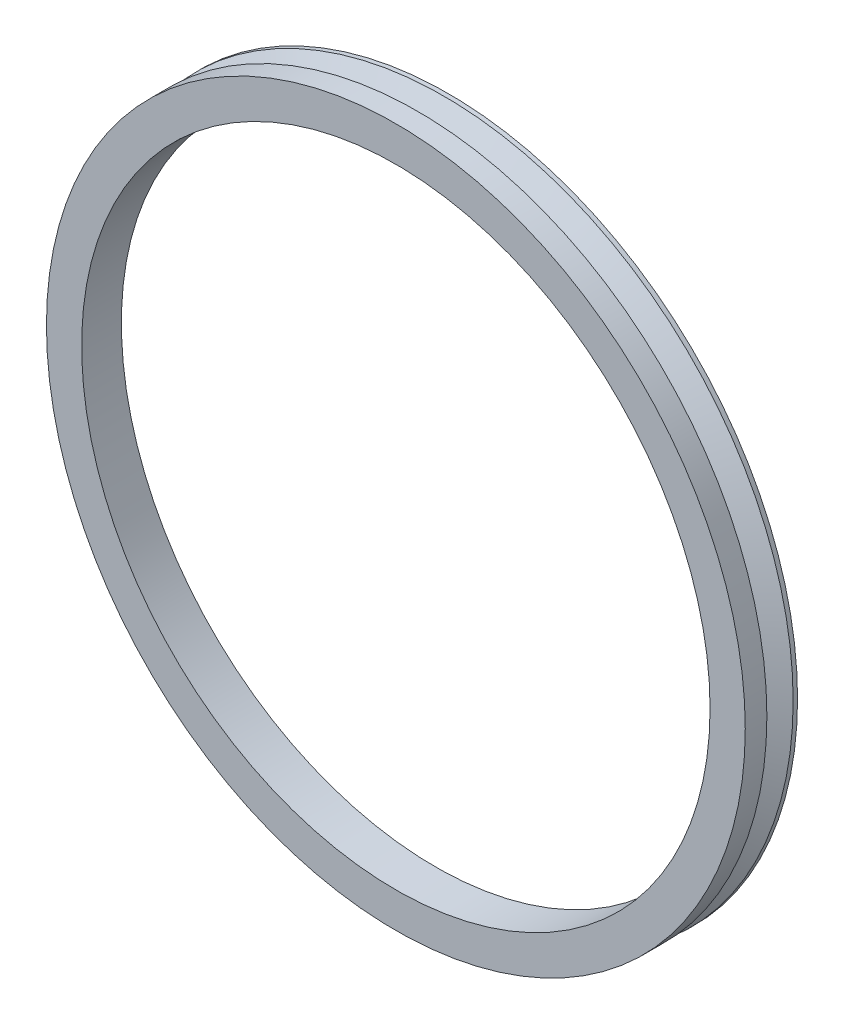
ISO-10303-21;
HEADER;
FILE_DESCRIPTION(('STEP AP214'),'2;1');
FILE_NAME('part.step','',(''),(''),'','','');
FILE_SCHEMA(('AUTOMOTIVE_DESIGN { 1 0 10303 214 1 1 1 1 }'));
ENDSEC;
DATA;
#1=APPLICATION_CONTEXT('core data for automotive mechanical design processes');
#2=APPLICATION_PROTOCOL_DEFINITION('international standard','automotive_design',2000,#1);
#3=PRODUCT_CONTEXT('',#1,'mechanical');
#4=PRODUCT('Part','Part','',(#3));
#5=PRODUCT_RELATED_PRODUCT_CATEGORY('part','',(#4));
#6=PRODUCT_DEFINITION_FORMATION('','',#4);
#7=PRODUCT_DEFINITION_CONTEXT('part definition',#1,'design');
#8=PRODUCT_DEFINITION('design','',#6,#7);
#9=PRODUCT_DEFINITION_SHAPE('','',#8);
#10=(LENGTH_UNIT() NAMED_UNIT(*) SI_UNIT(.MILLI.,.METRE.));
#11=(NAMED_UNIT(*) PLANE_ANGLE_UNIT() SI_UNIT($,.RADIAN.));
#12=(NAMED_UNIT(*) SI_UNIT($,.STERADIAN.) SOLID_ANGLE_UNIT());
#13=UNCERTAINTY_MEASURE_WITH_UNIT(LENGTH_MEASURE(1.E-05),#10,'distance_accuracy_value','');
#14=(GEOMETRIC_REPRESENTATION_CONTEXT(3) GLOBAL_UNCERTAINTY_ASSIGNED_CONTEXT((#13)) GLOBAL_UNIT_ASSIGNED_CONTEXT((#10,
#11,#12)) REPRESENTATION_CONTEXT('',''));
#15=CARTESIAN_POINT('',(0.,0.,0.));
#16=DIRECTION('',(0.,0.,1.));
#17=DIRECTION('',(1.,0.,0.));
#18=AXIS2_PLACEMENT_3D('',#15,#16,#17);
#19=CARTESIAN_POINT('',(0.,69.5,0.));
#20=DIRECTION('',(0.,0.,-1.));
#21=DIRECTION('',(-1.,0.,0.));
#22=AXIS2_PLACEMENT_3D('',#19,#20,#21);
#23=PLANE('',#22);
#24=CARTESIAN_POINT('',(0.,0.,0.));
#25=DIRECTION('',(0.,0.,1.));
#26=DIRECTION('',(1.,0.,0.));
#27=AXIS2_PLACEMENT_3D('',#24,#25,#26);
#28=CIRCLE('',#27,62.5);
#29=CARTESIAN_POINT('',(62.5,0.,0.));
#30=VERTEX_POINT('',#29);
#31=EDGE_CURVE('E10',#30,#30,#28,.T.);
#32=ORIENTED_EDGE('',*,*,#31,.F.);
#33=EDGE_LOOP('',(#32));
#34=FACE_BOUND('',#33,.T.);
#35=CARTESIAN_POINT('',(0.,0.,0.));
#36=DIRECTION('',(0.,0.,1.));
#37=DIRECTION('',(1.,0.,0.));
#38=AXIS2_PLACEMENT_3D('',#35,#36,#37);
#39=CIRCLE('',#38,69.5);
#40=CARTESIAN_POINT('',(69.5,0.,0.));
#41=VERTEX_POINT('',#40);
#42=EDGE_CURVE('E60',#41,#41,#39,.T.);
#43=ORIENTED_EDGE('',*,*,#42,.T.);
#44=EDGE_LOOP('',(#43));
#45=FACE_BOUND('',#44,.T.);
#46=ADVANCED_FACE('F35',(#34,#45),#23,.F.);
#47=CARTESIAN_POINT('',(0.,0.,0.));
#48=DIRECTION('',(0.,0.,1.));
#49=DIRECTION('',(1.,0.,0.));
#50=AXIS2_PLACEMENT_3D('',#47,#48,#49);
#51=CYLINDRICAL_SURFACE('',#50,62.5);
#52=CARTESIAN_POINT('',(0.,0.,-7.9));
#53=DIRECTION('',(0.,0.,1.));
#54=DIRECTION('',(1.,0.,0.));
#55=AXIS2_PLACEMENT_3D('',#52,#53,#54);
#56=CIRCLE('',#55,62.5);
#57=CARTESIAN_POINT('',(62.5,0.,-7.9));
#58=VERTEX_POINT('',#57);
#59=EDGE_CURVE('E41',#58,#58,#56,.T.);
#60=ORIENTED_EDGE('',*,*,#59,.F.);
#61=EDGE_LOOP('',(#60));
#62=FACE_BOUND('',#61,.T.);
#63=ORIENTED_EDGE('',*,*,#31,.T.);
#64=EDGE_LOOP('',(#63));
#65=FACE_BOUND('',#64,.T.);
#66=ADVANCED_FACE('F91',(#62,#65),#51,.F.);
#67=CARTESIAN_POINT('',(0.,0.,-7.9));
#68=DIRECTION('',(0.,0.,-1.));
#69=DIRECTION('',(-1.,0.,0.));
#70=AXIS2_PLACEMENT_3D('',#67,#68,#69);
#71=CONICAL_SURFACE('',#70,62.5,1.22777238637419);
#72=CARTESIAN_POINT('',(0.,0.,-10.4));
#73=DIRECTION('',(0.,0.,1.));
#74=DIRECTION('',(1.,0.,0.));
#75=AXIS2_PLACEMENT_3D('',#72,#73,#74);
#76=CIRCLE('',#75,69.5);
#77=CARTESIAN_POINT('',(69.5,0.,-10.4));
#78=VERTEX_POINT('',#77);
#79=EDGE_CURVE('E45',#78,#78,#76,.T.);
#80=ORIENTED_EDGE('',*,*,#79,.F.);
#81=EDGE_LOOP('',(#80));
#82=FACE_BOUND('',#81,.T.);
#83=ORIENTED_EDGE('',*,*,#59,.T.);
#84=EDGE_LOOP('',(#83));
#85=FACE_BOUND('',#84,.T.);
#86=ADVANCED_FACE('F86',(#82,#85),#71,.F.);
#87=CARTESIAN_POINT('',(0.,0.,0.));
#88=DIRECTION('',(0.,0.,1.));
#89=DIRECTION('',(1.,0.,0.));
#90=AXIS2_PLACEMENT_3D('',#87,#88,#89);
#91=CYLINDRICAL_SURFACE('',#90,69.5);
#92=CARTESIAN_POINT('',(0.,0.,-9.525));
#93=DIRECTION('',(0.,0.,1.));
#94=DIRECTION('',(1.,0.,0.));
#95=AXIS2_PLACEMENT_3D('',#92,#93,#94);
#96=CIRCLE('',#95,69.5);
#97=CARTESIAN_POINT('',(69.5,0.,-9.525));
#98=VERTEX_POINT('',#97);
#99=EDGE_CURVE('E49',#98,#98,#96,.T.);
#100=ORIENTED_EDGE('',*,*,#99,.F.);
#101=EDGE_LOOP('',(#100));
#102=FACE_BOUND('',#101,.T.);
#103=ORIENTED_EDGE('',*,*,#79,.T.);
#104=EDGE_LOOP('',(#103));
#105=FACE_BOUND('',#104,.T.);
#106=ADVANCED_FACE('F80',(#102,#105),#91,.T.);
#107=CARTESIAN_POINT('',(0.,0.,-9.525));
#108=DIRECTION('',(0.,0.,-1.));
#109=DIRECTION('',(-1.,0.,0.));
#110=AXIS2_PLACEMENT_3D('',#107,#108,#109);
#111=CONICAL_SURFACE('',#110,69.5,1.05323946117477);
#112=CARTESIAN_POINT('',(0.,0.,-6.3367951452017));
#113=DIRECTION('',(0.,0.,1.));
#114=DIRECTION('',(1.,0.,0.));
#115=AXIS2_PLACEMENT_3D('',#112,#113,#114);
#116=CIRCLE('',#115,63.9);
#117=CARTESIAN_POINT('',(63.9,0.,-6.3367951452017));
#118=VERTEX_POINT('',#117);
#119=EDGE_CURVE('E54',#118,#118,#116,.T.);
#120=ORIENTED_EDGE('',*,*,#119,.F.);
#121=EDGE_LOOP('',(#120));
#122=FACE_BOUND('',#121,.T.);
#123=ORIENTED_EDGE('',*,*,#99,.T.);
#124=EDGE_LOOP('',(#123));
#125=FACE_BOUND('',#124,.T.);
#126=ADVANCED_FACE('F74',(#122,#125),#111,.T.);
#127=CARTESIAN_POINT('',(0.,0.,-6.3367951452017));
#128=DIRECTION('',(0.,0.,1.));
#129=DIRECTION('',(1.,0.,0.));
#130=AXIS2_PLACEMENT_3D('',#127,#128,#129);
#131=CONICAL_SURFACE('',#130,63.9,1.22173047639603);
#132=CARTESIAN_POINT('',(0.,0.,-4.29856183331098));
#133=DIRECTION('',(0.,0.,1.));
#134=DIRECTION('',(1.,0.,0.));
#135=AXIS2_PLACEMENT_3D('',#132,#133,#134);
#136=CIRCLE('',#135,69.5);
#137=CARTESIAN_POINT('',(69.5,0.,-4.29856183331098));
#138=VERTEX_POINT('',#137);
#139=EDGE_CURVE('E57',#138,#138,#136,.T.);
#140=ORIENTED_EDGE('',*,*,#139,.F.);
#141=EDGE_LOOP('',(#140));
#142=FACE_BOUND('',#141,.T.);
#143=ORIENTED_EDGE('',*,*,#119,.T.);
#144=EDGE_LOOP('',(#143));
#145=FACE_BOUND('',#144,.T.);
#146=ADVANCED_FACE('F68',(#142,#145),#131,.T.);
#147=CARTESIAN_POINT('',(0.,0.,0.));
#148=DIRECTION('',(0.,0.,1.));
#149=DIRECTION('',(1.,0.,0.));
#150=AXIS2_PLACEMENT_3D('',#147,#148,#149);
#151=CYLINDRICAL_SURFACE('',#150,69.5);
#152=ORIENTED_EDGE('',*,*,#42,.F.);
#153=EDGE_LOOP('',(#152));
#154=FACE_BOUND('',#153,.T.);
#155=ORIENTED_EDGE('',*,*,#139,.T.);
#156=EDGE_LOOP('',(#155));
#157=FACE_BOUND('',#156,.T.);
#158=ADVANCED_FACE('F65',(#154,#157),#151,.T.);
#159=CLOSED_SHELL('',(#46,#66,#86,#106,#126,#146,#158));
#160=MANIFOLD_SOLID_BREP('B2',#159);
#161=ADVANCED_BREP_SHAPE_REPRESENTATION('',(#18,#160),#14);
#162=SHAPE_DEFINITION_REPRESENTATION(#9,#161);
ENDSEC;
END-ISO-10303-21;
